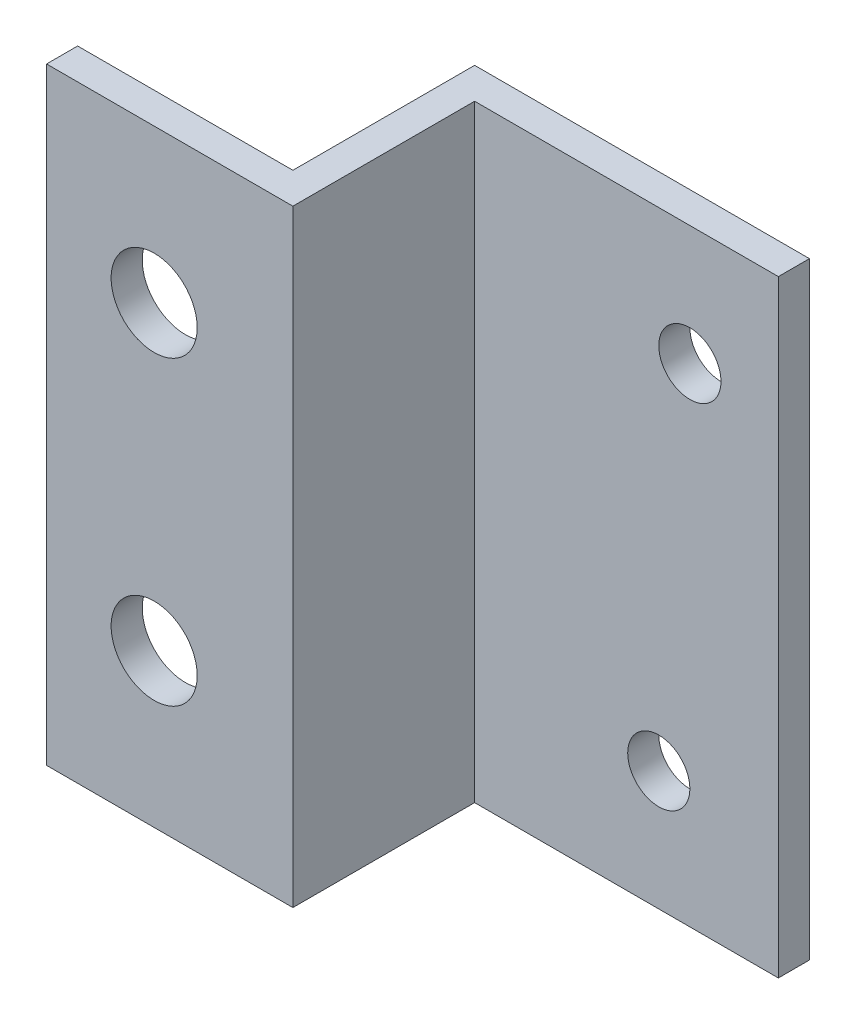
ISO-10303-21;
HEADER;
FILE_DESCRIPTION(('STEP AP214'),'2;1');
FILE_NAME('part.step','',(''),(''),'','','');
FILE_SCHEMA(('AUTOMOTIVE_DESIGN { 1 0 10303 214 1 1 1 1 }'));
ENDSEC;
DATA;
#1=APPLICATION_CONTEXT('core data for automotive mechanical design processes');
#2=APPLICATION_PROTOCOL_DEFINITION('international standard','automotive_design',2000,#1);
#3=PRODUCT_CONTEXT('',#1,'mechanical');
#4=PRODUCT('Part','Part','',(#3));
#5=PRODUCT_RELATED_PRODUCT_CATEGORY('part','',(#4));
#6=PRODUCT_DEFINITION_FORMATION('','',#4);
#7=PRODUCT_DEFINITION_CONTEXT('part definition',#1,'design');
#8=PRODUCT_DEFINITION('design','',#6,#7);
#9=PRODUCT_DEFINITION_SHAPE('','',#8);
#10=(LENGTH_UNIT() NAMED_UNIT(*) SI_UNIT(.MILLI.,.METRE.));
#11=(NAMED_UNIT(*) PLANE_ANGLE_UNIT() SI_UNIT($,.RADIAN.));
#12=(NAMED_UNIT(*) SI_UNIT($,.STERADIAN.) SOLID_ANGLE_UNIT());
#13=UNCERTAINTY_MEASURE_WITH_UNIT(LENGTH_MEASURE(1.E-05),#10,'distance_accuracy_value','');
#14=(GEOMETRIC_REPRESENTATION_CONTEXT(3) GLOBAL_UNCERTAINTY_ASSIGNED_CONTEXT((#13)) GLOBAL_UNIT_ASSIGNED_CONTEXT((#10,
#11,#12)) REPRESENTATION_CONTEXT('',''));
#15=CARTESIAN_POINT('',(0.,0.,0.));
#16=DIRECTION('',(0.,0.,1.));
#17=DIRECTION('',(1.,0.,0.));
#18=AXIS2_PLACEMENT_3D('',#15,#16,#17);
#19=CARTESIAN_POINT('',(-51.5,63.5,0.));
#20=DIRECTION('',(1.,0.,0.));
#21=DIRECTION('',(0.,0.,-1.));
#22=AXIS2_PLACEMENT_3D('',#19,#20,#21);
#23=PLANE('',#22);
#24=DIRECTION('',(0.,0.,1.));
#25=VECTOR('',#24,1.);
#26=CARTESIAN_POINT('',(-51.5,-63.5,0.));
#27=LINE('',#26,#25);
#28=CARTESIAN_POINT('',(-51.5,-63.5,-6.5));
#29=VERTEX_POINT('',#28);
#30=CARTESIAN_POINT('',(-51.5,-63.5,0.));
#31=VERTEX_POINT('',#30);
#32=EDGE_CURVE('E131',#29,#31,#27,.T.);
#33=ORIENTED_EDGE('',*,*,#32,.T.);
#34=DIRECTION('',(0.,-1.,0.));
#35=VECTOR('',#34,1.);
#36=CARTESIAN_POINT('',(-51.5,63.5,0.));
#37=LINE('',#36,#35);
#38=CARTESIAN_POINT('',(-51.5,63.5,0.));
#39=VERTEX_POINT('',#38);
#40=EDGE_CURVE('E11',#39,#31,#37,.T.);
#41=ORIENTED_EDGE('',*,*,#40,.F.);
#42=DIRECTION('',(0.,0.,1.));
#43=VECTOR('',#42,1.);
#44=CARTESIAN_POINT('',(-51.5,63.5,0.));
#45=LINE('',#44,#43);
#46=CARTESIAN_POINT('',(-51.5,63.5,-6.5));
#47=VERTEX_POINT('',#46);
#48=EDGE_CURVE('E146',#47,#39,#45,.T.);
#49=ORIENTED_EDGE('',*,*,#48,.F.);
#50=DIRECTION('',(0.,-1.,0.));
#51=VECTOR('',#50,1.);
#52=CARTESIAN_POINT('',(-51.5,63.5,-6.5));
#53=LINE('',#52,#51);
#54=EDGE_CURVE('E127',#47,#29,#53,.T.);
#55=ORIENTED_EDGE('',*,*,#54,.T.);
#56=EDGE_LOOP('',(#33,#41,#49,#55));
#57=FACE_BOUND('',#56,.T.);
#58=ADVANCED_FACE('F33',(#57),#23,.F.);
#59=CARTESIAN_POINT('',(-51.5,63.5,0.));
#60=DIRECTION('',(0.,0.,-1.));
#61=DIRECTION('',(-1.,0.,0.));
#62=AXIS2_PLACEMENT_3D('',#59,#60,#61);
#63=PLANE('',#62);
#64=CARTESIAN_POINT('',(-29.,-31.5,0.));
#65=DIRECTION('',(0.,0.,1.));
#66=DIRECTION('',(1.,0.,0.));
#67=AXIS2_PLACEMENT_3D('',#64,#65,#66);
#68=CIRCLE('',#67,9.);
#69=CARTESIAN_POINT('',(-20.,-31.5,0.));
#70=VERTEX_POINT('',#69);
#71=EDGE_CURVE('E165',#70,#70,#68,.T.);
#72=ORIENTED_EDGE('',*,*,#71,.F.);
#73=EDGE_LOOP('',(#72));
#74=FACE_BOUND('',#73,.T.);
#75=CARTESIAN_POINT('',(-29.,31.5,0.));
#76=DIRECTION('',(0.,0.,1.));
#77=DIRECTION('',(1.,0.,0.));
#78=AXIS2_PLACEMENT_3D('',#75,#76,#77);
#79=CIRCLE('',#78,9.00000000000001);
#80=CARTESIAN_POINT('',(-20.,31.5,0.));
#81=VERTEX_POINT('',#80);
#82=EDGE_CURVE('E159',#81,#81,#79,.T.);
#83=ORIENTED_EDGE('',*,*,#82,.F.);
#84=EDGE_LOOP('',(#83));
#85=FACE_BOUND('',#84,.T.);
#86=DIRECTION('',(1.,0.,0.));
#87=VECTOR('',#86,1.);
#88=CARTESIAN_POINT('',(-51.5,-63.5,0.));
#89=LINE('',#88,#87);
#90=CARTESIAN_POINT('',(0.,-63.5,0.));
#91=VERTEX_POINT('',#90);
#92=EDGE_CURVE('E134',#31,#91,#89,.T.);
#93=ORIENTED_EDGE('',*,*,#92,.T.);
#94=DIRECTION('',(0.,-1.,0.));
#95=VECTOR('',#94,1.);
#96=CARTESIAN_POINT('',(0.,63.5,0.));
#97=LINE('',#96,#95);
#98=CARTESIAN_POINT('',(0.,63.5,0.));
#99=VERTEX_POINT('',#98);
#100=EDGE_CURVE('E42',#99,#91,#97,.T.);
#101=ORIENTED_EDGE('',*,*,#100,.F.);
#102=DIRECTION('',(1.,0.,0.));
#103=VECTOR('',#102,1.);
#104=CARTESIAN_POINT('',(-51.5,63.5,0.));
#105=LINE('',#104,#103);
#106=EDGE_CURVE('E93',#39,#99,#105,.T.);
#107=ORIENTED_EDGE('',*,*,#106,.F.);
#108=ORIENTED_EDGE('',*,*,#40,.T.);
#109=EDGE_LOOP('',(#93,#101,#107,#108));
#110=FACE_BOUND('',#109,.T.);
#111=ADVANCED_FACE('F212',(#74,#85,#110),#63,.F.);
#112=CARTESIAN_POINT('',(0.,63.5,0.));
#113=DIRECTION('',(-1.,0.,0.));
#114=DIRECTION('',(0.,0.,1.));
#115=AXIS2_PLACEMENT_3D('',#112,#113,#114);
#116=PLANE('',#115);
#117=DIRECTION('',(0.,0.,-1.));
#118=VECTOR('',#117,1.);
#119=CARTESIAN_POINT('',(0.,-63.5,0.));
#120=LINE('',#119,#118);
#121=CARTESIAN_POINT('',(0.,-63.5,-38.));
#122=VERTEX_POINT('',#121);
#123=EDGE_CURVE('E137',#91,#122,#120,.T.);
#124=ORIENTED_EDGE('',*,*,#123,.T.);
#125=DIRECTION('',(0.,-1.,0.));
#126=VECTOR('',#125,1.);
#127=CARTESIAN_POINT('',(0.,63.5,-38.));
#128=LINE('',#127,#126);
#129=CARTESIAN_POINT('',(0.,63.5,-38.));
#130=VERTEX_POINT('',#129);
#131=EDGE_CURVE('E153',#130,#122,#128,.T.);
#132=ORIENTED_EDGE('',*,*,#131,.F.);
#133=DIRECTION('',(0.,0.,-1.));
#134=VECTOR('',#133,1.);
#135=CARTESIAN_POINT('',(0.,63.5,0.));
#136=LINE('',#135,#134);
#137=EDGE_CURVE('E180',#99,#130,#136,.T.);
#138=ORIENTED_EDGE('',*,*,#137,.F.);
#139=ORIENTED_EDGE('',*,*,#100,.T.);
#140=EDGE_LOOP('',(#124,#132,#138,#139));
#141=FACE_BOUND('',#140,.T.);
#142=ADVANCED_FACE('F216',(#141),#116,.F.);
#143=CARTESIAN_POINT('',(0.,63.5,-38.));
#144=DIRECTION('',(0.,0.,-1.));
#145=DIRECTION('',(-1.,0.,0.));
#146=AXIS2_PLACEMENT_3D('',#143,#144,#145);
#147=PLANE('',#146);
#148=CARTESIAN_POINT('',(45.,38.5,-38.));
#149=DIRECTION('',(0.,0.,-1.));
#150=DIRECTION('',(-1.,0.,0.));
#151=AXIS2_PLACEMENT_3D('',#148,#149,#150);
#152=CIRCLE('',#151,6.5);
#153=CARTESIAN_POINT('',(38.5,38.5,-38.));
#154=VERTEX_POINT('',#153);
#155=EDGE_CURVE('E135',#154,#154,#152,.T.);
#156=ORIENTED_EDGE('',*,*,#155,.T.);
#157=EDGE_LOOP('',(#156));
#158=FACE_BOUND('',#157,.T.);
#159=CARTESIAN_POINT('',(38.5,-38.5,-38.));
#160=DIRECTION('',(0.,0.,-1.));
#161=DIRECTION('',(-1.,0.,0.));
#162=AXIS2_PLACEMENT_3D('',#159,#160,#161);
#163=CIRCLE('',#162,6.5);
#164=CARTESIAN_POINT('',(32.,-38.5,-38.));
#165=VERTEX_POINT('',#164);
#166=EDGE_CURVE('E163',#165,#165,#163,.T.);
#167=ORIENTED_EDGE('',*,*,#166,.T.);
#168=EDGE_LOOP('',(#167));
#169=FACE_BOUND('',#168,.T.);
#170=DIRECTION('',(1.,0.,0.));
#171=VECTOR('',#170,1.);
#172=CARTESIAN_POINT('',(0.,-63.5,-38.));
#173=LINE('',#172,#171);
#174=CARTESIAN_POINT('',(63.5,-63.5,-38.));
#175=VERTEX_POINT('',#174);
#176=EDGE_CURVE('E139',#122,#175,#173,.T.);
#177=ORIENTED_EDGE('',*,*,#176,.T.);
#178=DIRECTION('',(0.,-1.,0.));
#179=VECTOR('',#178,1.);
#180=CARTESIAN_POINT('',(63.5,63.5,-38.));
#181=LINE('',#180,#179);
#182=CARTESIAN_POINT('',(63.5,63.5,-38.));
#183=VERTEX_POINT('',#182);
#184=EDGE_CURVE('E150',#183,#175,#181,.T.);
#185=ORIENTED_EDGE('',*,*,#184,.F.);
#186=DIRECTION('',(1.,0.,0.));
#187=VECTOR('',#186,1.);
#188=CARTESIAN_POINT('',(0.,63.5,-38.));
#189=LINE('',#188,#187);
#190=EDGE_CURVE('E182',#130,#183,#189,.T.);
#191=ORIENTED_EDGE('',*,*,#190,.F.);
#192=ORIENTED_EDGE('',*,*,#131,.T.);
#193=EDGE_LOOP('',(#177,#185,#191,#192));
#194=FACE_BOUND('',#193,.T.);
#195=ADVANCED_FACE('F188',(#158,#169,#194),#147,.F.);
#196=CARTESIAN_POINT('',(63.5,63.5,-44.5));
#197=DIRECTION('',(-1.,0.,0.));
#198=DIRECTION('',(0.,0.,1.));
#199=AXIS2_PLACEMENT_3D('',#196,#197,#198);
#200=PLANE('',#199);
#201=DIRECTION('',(0.,0.,-1.));
#202=VECTOR('',#201,1.);
#203=CARTESIAN_POINT('',(63.5,-63.5,-44.5));
#204=LINE('',#203,#202);
#205=CARTESIAN_POINT('',(63.5,-63.5,-44.5));
#206=VERTEX_POINT('',#205);
#207=EDGE_CURVE('E141',#175,#206,#204,.T.);
#208=ORIENTED_EDGE('',*,*,#207,.T.);
#209=DIRECTION('',(0.,-1.,0.));
#210=VECTOR('',#209,1.);
#211=CARTESIAN_POINT('',(63.5,63.5,-44.5));
#212=LINE('',#211,#210);
#213=CARTESIAN_POINT('',(63.5,63.5,-44.5));
#214=VERTEX_POINT('',#213);
#215=EDGE_CURVE('E122',#214,#206,#212,.T.);
#216=ORIENTED_EDGE('',*,*,#215,.F.);
#217=DIRECTION('',(0.,0.,-1.));
#218=VECTOR('',#217,1.);
#219=CARTESIAN_POINT('',(63.5,63.5,-44.5));
#220=LINE('',#219,#218);
#221=EDGE_CURVE('E112',#183,#214,#220,.T.);
#222=ORIENTED_EDGE('',*,*,#221,.F.);
#223=ORIENTED_EDGE('',*,*,#184,.T.);
#224=EDGE_LOOP('',(#208,#216,#222,#223));
#225=FACE_BOUND('',#224,.T.);
#226=ADVANCED_FACE('F192',(#225),#200,.F.);
#227=CARTESIAN_POINT('',(-6.5,63.5,-44.5));
#228=DIRECTION('',(0.,0.,1.));
#229=DIRECTION('',(1.,0.,0.));
#230=AXIS2_PLACEMENT_3D('',#227,#228,#229);
#231=PLANE('',#230);
#232=CARTESIAN_POINT('',(45.,38.5,-44.5));
#233=DIRECTION('',(0.,0.,1.));
#234=DIRECTION('',(1.,0.,0.));
#235=AXIS2_PLACEMENT_3D('',#232,#233,#234);
#236=CIRCLE('',#235,6.5);
#237=CARTESIAN_POINT('',(51.5,38.5,-44.5));
#238=VERTEX_POINT('',#237);
#239=EDGE_CURVE('E170',#238,#238,#236,.T.);
#240=ORIENTED_EDGE('',*,*,#239,.T.);
#241=EDGE_LOOP('',(#240));
#242=FACE_BOUND('',#241,.T.);
#243=CARTESIAN_POINT('',(38.5,-38.5,-44.5));
#244=DIRECTION('',(0.,0.,1.));
#245=DIRECTION('',(1.,0.,0.));
#246=AXIS2_PLACEMENT_3D('',#243,#244,#245);
#247=CIRCLE('',#246,6.5);
#248=CARTESIAN_POINT('',(45.,-38.5,-44.5));
#249=VERTEX_POINT('',#248);
#250=EDGE_CURVE('E240',#249,#249,#247,.T.);
#251=ORIENTED_EDGE('',*,*,#250,.T.);
#252=EDGE_LOOP('',(#251));
#253=FACE_BOUND('',#252,.T.);
#254=DIRECTION('',(-1.,0.,0.));
#255=VECTOR('',#254,1.);
#256=CARTESIAN_POINT('',(-6.5,-63.5,-44.5));
#257=LINE('',#256,#255);
#258=CARTESIAN_POINT('',(-6.5,-63.5,-44.5));
#259=VERTEX_POINT('',#258);
#260=EDGE_CURVE('E121',#206,#259,#257,.T.);
#261=ORIENTED_EDGE('',*,*,#260,.T.);
#262=DIRECTION('',(0.,-1.,0.));
#263=VECTOR('',#262,1.);
#264=CARTESIAN_POINT('',(-6.5,63.5,-44.5));
#265=LINE('',#264,#263);
#266=CARTESIAN_POINT('',(-6.5,63.5,-44.5));
#267=VERTEX_POINT('',#266);
#268=EDGE_CURVE('E118',#267,#259,#265,.T.);
#269=ORIENTED_EDGE('',*,*,#268,.F.);
#270=DIRECTION('',(-1.,0.,0.));
#271=VECTOR('',#270,1.);
#272=CARTESIAN_POINT('',(-6.5,63.5,-44.5));
#273=LINE('',#272,#271);
#274=EDGE_CURVE('E106',#214,#267,#273,.T.);
#275=ORIENTED_EDGE('',*,*,#274,.F.);
#276=ORIENTED_EDGE('',*,*,#215,.T.);
#277=EDGE_LOOP('',(#261,#269,#275,#276));
#278=FACE_BOUND('',#277,.T.);
#279=ADVANCED_FACE('F119',(#242,#253,#278),#231,.F.);
#280=CARTESIAN_POINT('',(-6.5,63.5,-6.5));
#281=DIRECTION('',(1.,0.,0.));
#282=DIRECTION('',(0.,0.,-1.));
#283=AXIS2_PLACEMENT_3D('',#280,#281,#282);
#284=PLANE('',#283);
#285=DIRECTION('',(0.,0.,1.));
#286=VECTOR('',#285,1.);
#287=CARTESIAN_POINT('',(-6.5,-63.5,-6.5));
#288=LINE('',#287,#286);
#289=CARTESIAN_POINT('',(-6.5,-63.5,-6.5));
#290=VERTEX_POINT('',#289);
#291=EDGE_CURVE('E79',#259,#290,#288,.T.);
#292=ORIENTED_EDGE('',*,*,#291,.T.);
#293=DIRECTION('',(0.,-1.,0.));
#294=VECTOR('',#293,1.);
#295=CARTESIAN_POINT('',(-6.5,63.5,-6.5));
#296=LINE('',#295,#294);
#297=CARTESIAN_POINT('',(-6.5,63.5,-6.5));
#298=VERTEX_POINT('',#297);
#299=EDGE_CURVE('E123',#298,#290,#296,.T.);
#300=ORIENTED_EDGE('',*,*,#299,.F.);
#301=DIRECTION('',(0.,0.,1.));
#302=VECTOR('',#301,1.);
#303=CARTESIAN_POINT('',(-6.5,63.5,-44.5));
#304=LINE('',#303,#302);
#305=EDGE_CURVE('E110',#267,#298,#304,.T.);
#306=ORIENTED_EDGE('',*,*,#305,.F.);
#307=ORIENTED_EDGE('',*,*,#268,.T.);
#308=EDGE_LOOP('',(#292,#300,#306,#307));
#309=FACE_BOUND('',#308,.T.);
#310=ADVANCED_FACE('F125',(#309),#284,.F.);
#311=CARTESIAN_POINT('',(-51.5,63.5,-6.5));
#312=DIRECTION('',(0.,0.,1.));
#313=DIRECTION('',(1.,0.,0.));
#314=AXIS2_PLACEMENT_3D('',#311,#312,#313);
#315=PLANE('',#314);
#316=CARTESIAN_POINT('',(-29.,-31.5,-6.5));
#317=DIRECTION('',(0.,0.,1.));
#318=DIRECTION('',(1.,0.,0.));
#319=AXIS2_PLACEMENT_3D('',#316,#317,#318);
#320=CIRCLE('',#319,9.);
#321=CARTESIAN_POINT('',(-20.,-31.5,-6.5));
#322=VERTEX_POINT('',#321);
#323=EDGE_CURVE('E36',#322,#322,#320,.T.);
#324=ORIENTED_EDGE('',*,*,#323,.T.);
#325=EDGE_LOOP('',(#324));
#326=FACE_BOUND('',#325,.T.);
#327=CARTESIAN_POINT('',(-29.,31.5,-6.5));
#328=DIRECTION('',(0.,0.,1.));
#329=DIRECTION('',(1.,0.,0.));
#330=AXIS2_PLACEMENT_3D('',#327,#328,#329);
#331=CIRCLE('',#330,9.00000000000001);
#332=CARTESIAN_POINT('',(-20.,31.5,-6.5));
#333=VERTEX_POINT('',#332);
#334=EDGE_CURVE('E157',#333,#333,#331,.T.);
#335=ORIENTED_EDGE('',*,*,#334,.T.);
#336=EDGE_LOOP('',(#335));
#337=FACE_BOUND('',#336,.T.);
#338=DIRECTION('',(-1.,0.,0.));
#339=VECTOR('',#338,1.);
#340=CARTESIAN_POINT('',(-51.5,-63.5,-6.5));
#341=LINE('',#340,#339);
#342=EDGE_CURVE('E85',#290,#29,#341,.T.);
#343=ORIENTED_EDGE('',*,*,#342,.T.);
#344=ORIENTED_EDGE('',*,*,#54,.F.);
#345=DIRECTION('',(-1.,0.,0.));
#346=VECTOR('',#345,1.);
#347=CARTESIAN_POINT('',(-51.5,63.5,-6.5));
#348=LINE('',#347,#346);
#349=EDGE_CURVE('E51',#298,#47,#348,.T.);
#350=ORIENTED_EDGE('',*,*,#349,.F.);
#351=ORIENTED_EDGE('',*,*,#299,.T.);
#352=EDGE_LOOP('',(#343,#344,#350,#351));
#353=FACE_BOUND('',#352,.T.);
#354=ADVANCED_FACE('F200',(#326,#337,#353),#315,.F.);
#355=CARTESIAN_POINT('',(0.,63.5,0.));
#356=DIRECTION('',(0.,-1.,0.));
#357=DIRECTION('',(0.,0.,-1.));
#358=AXIS2_PLACEMENT_3D('',#355,#356,#357);
#359=PLANE('',#358);
#360=ORIENTED_EDGE('',*,*,#48,.T.);
#361=ORIENTED_EDGE('',*,*,#106,.T.);
#362=ORIENTED_EDGE('',*,*,#137,.T.);
#363=ORIENTED_EDGE('',*,*,#190,.T.);
#364=ORIENTED_EDGE('',*,*,#221,.T.);
#365=ORIENTED_EDGE('',*,*,#274,.T.);
#366=ORIENTED_EDGE('',*,*,#305,.T.);
#367=ORIENTED_EDGE('',*,*,#349,.T.);
#368=EDGE_LOOP('',(#360,#361,#362,#363,#364,#365,#366,#367));
#369=FACE_BOUND('',#368,.T.);
#370=ADVANCED_FACE('F108',(#369),#359,.F.);
#371=CARTESIAN_POINT('',(0.,-63.5,0.));
#372=DIRECTION('',(0.,-1.,0.));
#373=DIRECTION('',(0.,0.,-1.));
#374=AXIS2_PLACEMENT_3D('',#371,#372,#373);
#375=PLANE('',#374);
#376=ORIENTED_EDGE('',*,*,#32,.F.);
#377=ORIENTED_EDGE('',*,*,#342,.F.);
#378=ORIENTED_EDGE('',*,*,#291,.F.);
#379=ORIENTED_EDGE('',*,*,#260,.F.);
#380=ORIENTED_EDGE('',*,*,#207,.F.);
#381=ORIENTED_EDGE('',*,*,#176,.F.);
#382=ORIENTED_EDGE('',*,*,#123,.F.);
#383=ORIENTED_EDGE('',*,*,#92,.F.);
#384=EDGE_LOOP('',(#376,#377,#378,#379,#380,#381,#382,#383));
#385=FACE_BOUND('',#384,.T.);
#386=ADVANCED_FACE('F195',(#385),#375,.T.);
#387=CARTESIAN_POINT('',(-29.,31.5,-44.5));
#388=DIRECTION('',(0.,0.,1.));
#389=DIRECTION('',(1.,0.,0.));
#390=AXIS2_PLACEMENT_3D('',#387,#388,#389);
#391=CYLINDRICAL_SURFACE('',#390,9.00000000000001);
#392=ORIENTED_EDGE('',*,*,#82,.T.);
#393=EDGE_LOOP('',(#392));
#394=FACE_BOUND('',#393,.T.);
#395=ORIENTED_EDGE('',*,*,#334,.F.);
#396=EDGE_LOOP('',(#395));
#397=FACE_BOUND('',#396,.T.);
#398=ADVANCED_FACE('F257',(#394,#397),#391,.F.);
#399=CARTESIAN_POINT('',(-29.,-31.5,-44.5));
#400=DIRECTION('',(0.,0.,1.));
#401=DIRECTION('',(1.,0.,0.));
#402=AXIS2_PLACEMENT_3D('',#399,#400,#401);
#403=CYLINDRICAL_SURFACE('',#402,9.);
#404=ORIENTED_EDGE('',*,*,#71,.T.);
#405=EDGE_LOOP('',(#404));
#406=FACE_BOUND('',#405,.T.);
#407=ORIENTED_EDGE('',*,*,#323,.F.);
#408=EDGE_LOOP('',(#407));
#409=FACE_BOUND('',#408,.T.);
#410=ADVANCED_FACE('F247',(#406,#409),#403,.F.);
#411=CARTESIAN_POINT('',(38.5,-38.5,-44.5));
#412=DIRECTION('',(0.,0.,1.));
#413=DIRECTION('',(1.,0.,0.));
#414=AXIS2_PLACEMENT_3D('',#411,#412,#413);
#415=CYLINDRICAL_SURFACE('',#414,6.5);
#416=ORIENTED_EDGE('',*,*,#250,.F.);
#417=EDGE_LOOP('',(#416));
#418=FACE_BOUND('',#417,.T.);
#419=ORIENTED_EDGE('',*,*,#166,.F.);
#420=EDGE_LOOP('',(#419));
#421=FACE_BOUND('',#420,.T.);
#422=ADVANCED_FACE('F243',(#418,#421),#415,.F.);
#423=CARTESIAN_POINT('',(45.,38.5,-44.5));
#424=DIRECTION('',(0.,0.,1.));
#425=DIRECTION('',(1.,0.,0.));
#426=AXIS2_PLACEMENT_3D('',#423,#424,#425);
#427=CYLINDRICAL_SURFACE('',#426,6.5);
#428=ORIENTED_EDGE('',*,*,#239,.F.);
#429=EDGE_LOOP('',(#428));
#430=FACE_BOUND('',#429,.T.);
#431=ORIENTED_EDGE('',*,*,#155,.F.);
#432=EDGE_LOOP('',(#431));
#433=FACE_BOUND('',#432,.T.);
#434=ADVANCED_FACE('F246',(#430,#433),#427,.F.);
#435=CLOSED_SHELL('',(#58,#111,#142,#195,#226,#279,#310,#354,#370,#386,#398,#410,#422,#434));
#436=MANIFOLD_SOLID_BREP('B2',#435);
#437=ADVANCED_BREP_SHAPE_REPRESENTATION('',(#18,#436),#14);
#438=SHAPE_DEFINITION_REPRESENTATION(#9,#437);
ENDSEC;
END-ISO-10303-21;
